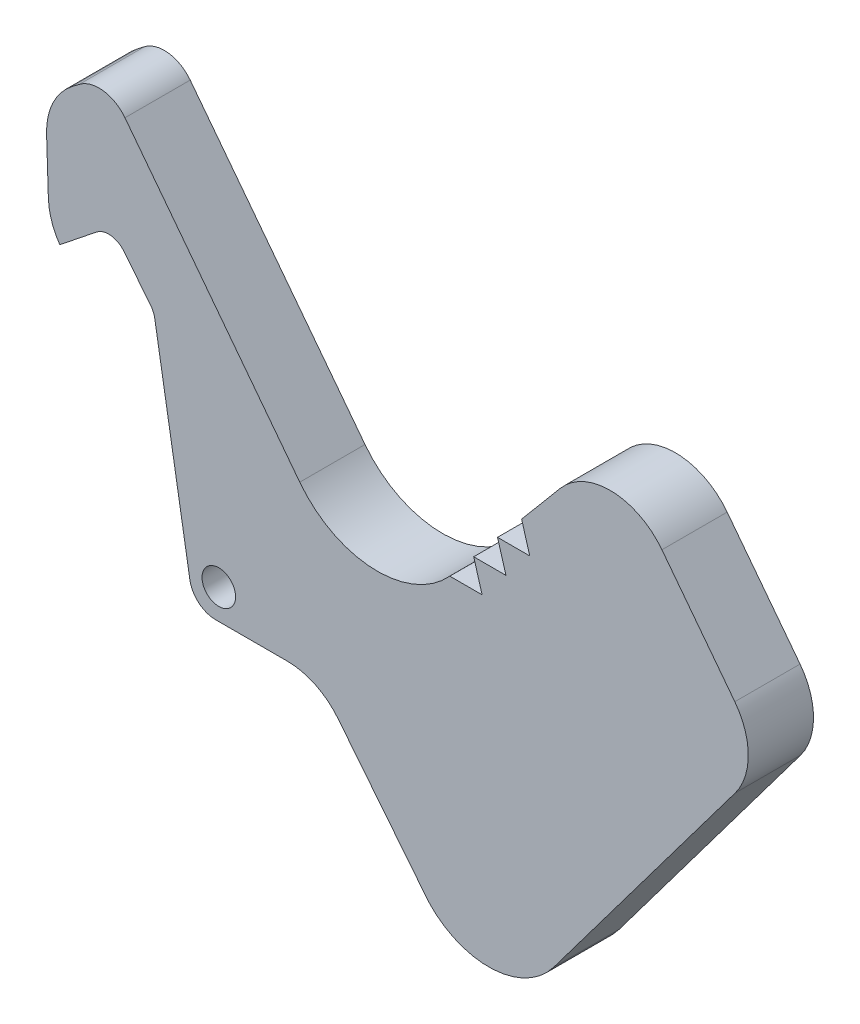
ISO-10303-21;
HEADER;
FILE_DESCRIPTION(('STEP AP214'),'2;1');
FILE_NAME('part.step','',(''),(''),'','','');
FILE_SCHEMA(('AUTOMOTIVE_DESIGN { 1 0 10303 214 1 1 1 1 }'));
ENDSEC;
DATA;
#1=APPLICATION_CONTEXT('core data for automotive mechanical design processes');
#2=APPLICATION_PROTOCOL_DEFINITION('international standard','automotive_design',2000,#1);
#3=PRODUCT_CONTEXT('',#1,'mechanical');
#4=PRODUCT('Part','Part','',(#3));
#5=PRODUCT_RELATED_PRODUCT_CATEGORY('part','',(#4));
#6=PRODUCT_DEFINITION_FORMATION('','',#4);
#7=PRODUCT_DEFINITION_CONTEXT('part definition',#1,'design');
#8=PRODUCT_DEFINITION('design','',#6,#7);
#9=PRODUCT_DEFINITION_SHAPE('','',#8);
#10=(LENGTH_UNIT() NAMED_UNIT(*) SI_UNIT(.MILLI.,.METRE.));
#11=(NAMED_UNIT(*) PLANE_ANGLE_UNIT() SI_UNIT($,.RADIAN.));
#12=(NAMED_UNIT(*) SI_UNIT($,.STERADIAN.) SOLID_ANGLE_UNIT());
#13=UNCERTAINTY_MEASURE_WITH_UNIT(LENGTH_MEASURE(1.E-05),#10,'distance_accuracy_value','');
#14=(GEOMETRIC_REPRESENTATION_CONTEXT(3) GLOBAL_UNCERTAINTY_ASSIGNED_CONTEXT((#13)) GLOBAL_UNIT_ASSIGNED_CONTEXT((#10,
#11,#12)) REPRESENTATION_CONTEXT('',''));
#15=CARTESIAN_POINT('',(0.,0.,0.));
#16=DIRECTION('',(0.,0.,1.));
#17=DIRECTION('',(1.,0.,0.));
#18=AXIS2_PLACEMENT_3D('',#15,#16,#17);
#19=CARTESIAN_POINT('',(50.298696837,93.87980843,0.));
#20=DIRECTION('',(0.959637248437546,0.281240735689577,0.));
#21=DIRECTION('',(-0.281240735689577,0.959637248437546,0.));
#22=AXIS2_PLACEMENT_3D('',#19,#20,#21);
#23=PLANE('',#22);
#24=DIRECTION('',(0.,0.,1.));
#25=VECTOR('',#24,1.);
#26=CARTESIAN_POINT('',(50.298696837,93.87980843,1.27));
#27=LINE('',#26,#25);
#28=CARTESIAN_POINT('',(50.298696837,93.87980843,0.));
#29=VERTEX_POINT('',#28);
#30=CARTESIAN_POINT('',(50.298696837,93.87980843,2.54));
#31=VERTEX_POINT('',#30);
#32=EDGE_CURVE('E304',#29,#31,#27,.T.);
#33=ORIENTED_EDGE('',*,*,#32,.T.);
#34=DIRECTION('',(0.281240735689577,-0.959637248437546,0.));
#35=VECTOR('',#34,1.);
#36=CARTESIAN_POINT('',(50.1346680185,94.4395003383,2.54));
#37=LINE('',#36,#35);
#38=CARTESIAN_POINT('',(49.9706392,94.9991922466,2.54));
#39=VERTEX_POINT('',#38);
#40=EDGE_CURVE('E310',#39,#31,#37,.T.);
#41=ORIENTED_EDGE('',*,*,#40,.F.);
#42=DIRECTION('',(0.,0.,-1.));
#43=VECTOR('',#42,1.);
#44=CARTESIAN_POINT('',(49.9706392,94.9991922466,1.27));
#45=LINE('',#44,#43);
#46=CARTESIAN_POINT('',(49.9706392,94.9991922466,0.));
#47=VERTEX_POINT('',#46);
#48=EDGE_CURVE('E292',#39,#47,#45,.T.);
#49=ORIENTED_EDGE('',*,*,#48,.T.);
#50=DIRECTION('',(-0.281240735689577,0.959637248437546,0.));
#51=VECTOR('',#50,1.);
#52=CARTESIAN_POINT('',(50.1346680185,94.4395003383,0.));
#53=LINE('',#52,#51);
#54=EDGE_CURVE('E307',#29,#47,#53,.T.);
#55=ORIENTED_EDGE('',*,*,#54,.F.);
#56=EDGE_LOOP('',(#33,#41,#49,#55));
#57=FACE_BOUND('',#56,.T.);
#58=ADVANCED_FACE('F16',(#57),#23,.F.);
#59=CARTESIAN_POINT('',(49.0432790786,93.87980843,2.54));
#60=DIRECTION('',(0.,-1.,0.));
#61=DIRECTION('',(0.,0.,-1.));
#62=AXIS2_PLACEMENT_3D('',#59,#60,#61);
#63=PLANE('',#62);
#64=DIRECTION('',(0.,0.,1.));
#65=VECTOR('',#64,1.);
#66=CARTESIAN_POINT('',(49.0432790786,93.87980843,1.27));
#67=LINE('',#66,#65);
#68=CARTESIAN_POINT('',(49.0432790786,93.87980843,0.));
#69=VERTEX_POINT('',#68);
#70=CARTESIAN_POINT('',(49.0432790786,93.87980843,2.54));
#71=VERTEX_POINT('',#70);
#72=EDGE_CURVE('E286',#69,#71,#67,.T.);
#73=ORIENTED_EDGE('',*,*,#72,.T.);
#74=DIRECTION('',(-1.,0.,0.));
#75=VECTOR('',#74,1.);
#76=CARTESIAN_POINT('',(49.6709879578,93.87980843,2.54));
#77=LINE('',#76,#75);
#78=EDGE_CURVE('E301',#31,#71,#77,.T.);
#79=ORIENTED_EDGE('',*,*,#78,.F.);
#80=ORIENTED_EDGE('',*,*,#32,.F.);
#81=DIRECTION('',(1.,0.,0.));
#82=VECTOR('',#81,1.);
#83=CARTESIAN_POINT('',(49.6709879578,93.87980843,0.));
#84=LINE('',#83,#82);
#85=EDGE_CURVE('E296',#69,#29,#84,.T.);
#86=ORIENTED_EDGE('',*,*,#85,.F.);
#87=EDGE_LOOP('',(#73,#79,#80,#86));
#88=FACE_BOUND('',#87,.T.);
#89=ADVANCED_FACE('F714',(#88),#63,.F.);
#90=CARTESIAN_POINT('',(49.9706392,94.9991922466,2.54));
#91=DIRECTION('',(0.,-1.,0.));
#92=DIRECTION('',(0.,0.,-1.));
#93=AXIS2_PLACEMENT_3D('',#90,#91,#92);
#94=PLANE('',#93);
#95=ORIENTED_EDGE('',*,*,#48,.F.);
#96=DIRECTION('',(-1.,0.,0.));
#97=VECTOR('',#96,1.);
#98=CARTESIAN_POINT('',(50.5983462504,94.9991922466,2.54));
#99=LINE('',#98,#97);
#100=CARTESIAN_POINT('',(51.2260533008,94.9991922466,2.54));
#101=VERTEX_POINT('',#100);
#102=EDGE_CURVE('E293',#101,#39,#99,.T.);
#103=ORIENTED_EDGE('',*,*,#102,.F.);
#104=DIRECTION('',(0.,0.,-1.));
#105=VECTOR('',#104,1.);
#106=CARTESIAN_POINT('',(51.2260533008,94.9991922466,1.27));
#107=LINE('',#106,#105);
#108=CARTESIAN_POINT('',(51.2260533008,94.9991922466,0.));
#109=VERTEX_POINT('',#108);
#110=EDGE_CURVE('E265',#101,#109,#107,.T.);
#111=ORIENTED_EDGE('',*,*,#110,.T.);
#112=DIRECTION('',(1.,0.,0.));
#113=VECTOR('',#112,1.);
#114=CARTESIAN_POINT('',(50.5983462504,94.9991922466,0.));
#115=LINE('',#114,#113);
#116=EDGE_CURVE('E289',#47,#109,#115,.T.);
#117=ORIENTED_EDGE('',*,*,#116,.F.);
#118=EDGE_LOOP('',(#95,#103,#111,#117));
#119=FACE_BOUND('',#118,.T.);
#120=ADVANCED_FACE('F705',(#119),#94,.F.);
#121=CARTESIAN_POINT('',(49.3713376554,92.7604213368,0.));
#122=DIRECTION('',(0.959637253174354,0.281240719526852,0.));
#123=DIRECTION('',(-0.281240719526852,0.959637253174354,0.));
#124=AXIS2_PLACEMENT_3D('',#121,#122,#123);
#125=PLANE('',#124);
#126=DIRECTION('',(0.,0.,1.));
#127=VECTOR('',#126,1.);
#128=CARTESIAN_POINT('',(49.3713376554,92.7604213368,1.27));
#129=LINE('',#128,#127);
#130=CARTESIAN_POINT('',(49.3713376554,92.7604213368,0.));
#131=VERTEX_POINT('',#130);
#132=CARTESIAN_POINT('',(49.3713376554,92.7604213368,2.54));
#133=VERTEX_POINT('',#132);
#134=EDGE_CURVE('E259',#131,#133,#129,.T.);
#135=ORIENTED_EDGE('',*,*,#134,.T.);
#136=DIRECTION('',(0.281240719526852,-0.959637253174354,0.));
#137=VECTOR('',#136,1.);
#138=CARTESIAN_POINT('',(49.207308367,93.3201148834,2.54));
#139=LINE('',#138,#137);
#140=EDGE_CURVE('E283',#71,#133,#139,.T.);
#141=ORIENTED_EDGE('',*,*,#140,.F.);
#142=ORIENTED_EDGE('',*,*,#72,.F.);
#143=DIRECTION('',(-0.281240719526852,0.959637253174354,0.));
#144=VECTOR('',#143,1.);
#145=CARTESIAN_POINT('',(49.207308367,93.3201148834,0.));
#146=LINE('',#145,#144);
#147=EDGE_CURVE('E272',#131,#69,#146,.T.);
#148=ORIENTED_EDGE('',*,*,#147,.F.);
#149=EDGE_LOOP('',(#135,#141,#142,#148));
#150=FACE_BOUND('',#149,.T.);
#151=ADVANCED_FACE('F697',(#150),#125,.F.);
#152=CARTESIAN_POINT('',(36.4664540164,96.0658623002,0.));
#153=DIRECTION('',(0.781083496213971,0.624426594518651,0.));
#154=DIRECTION('',(-0.624426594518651,0.781083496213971,0.));
#155=AXIS2_PLACEMENT_3D('',#152,#153,#154);
#156=PLANE('',#155);
#157=DIRECTION('',(0.,0.,1.));
#158=VECTOR('',#157,1.);
#159=CARTESIAN_POINT('',(36.4664540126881,96.0658622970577,1.27));
#160=LINE('',#159,#158);
#161=CARTESIAN_POINT('',(36.4664540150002,96.0658622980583,2.54));
#162=VERTEX_POINT('',#161);
#163=CARTESIAN_POINT('',(36.4664540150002,96.0658622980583,0.));
#164=VERTEX_POINT('',#163);
#165=EDGE_CURVE('E235',#162,#164,#160,.F.);
#166=ORIENTED_EDGE('',*,*,#165,.F.);
#167=DIRECTION('',(0.624426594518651,-0.781083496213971,0.));
#168=VECTOR('',#167,1.);
#169=CARTESIAN_POINT('',(35.9467267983,96.7159793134,2.54));
#170=LINE('',#169,#168);
#171=CARTESIAN_POINT('',(35.4269995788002,97.3660963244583,2.54));
#172=VERTEX_POINT('',#171);
#173=EDGE_CURVE('E269',#172,#162,#170,.T.);
#174=ORIENTED_EDGE('',*,*,#173,.F.);
#175=DIRECTION('',(0.,0.,-1.));
#176=VECTOR('',#175,1.);
#177=CARTESIAN_POINT('',(35.4269995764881,97.3660963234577,1.27));
#178=LINE('',#177,#176);
#179=CARTESIAN_POINT('',(35.4269995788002,97.3660963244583,0.));
#180=VERTEX_POINT('',#179);
#181=EDGE_CURVE('E242',#180,#172,#178,.F.);
#182=ORIENTED_EDGE('',*,*,#181,.F.);
#183=DIRECTION('',(-0.624426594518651,0.781083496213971,0.));
#184=VECTOR('',#183,1.);
#185=CARTESIAN_POINT('',(35.9467267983,96.7159793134,0.));
#186=LINE('',#185,#184);
#187=EDGE_CURVE('E266',#164,#180,#186,.T.);
#188=ORIENTED_EDGE('',*,*,#187,.F.);
#189=EDGE_LOOP('',(#166,#174,#182,#188));
#190=FACE_BOUND('',#189,.T.);
#191=ADVANCED_FACE('F440',(#190),#156,.F.);
#192=CARTESIAN_POINT('',(51.2260533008,94.9991922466,0.));
#193=DIRECTION('',(0.959637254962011,0.281240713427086,0.));
#194=DIRECTION('',(-0.281240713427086,0.959637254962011,0.));
#195=AXIS2_PLACEMENT_3D('',#192,#193,#194);
#196=PLANE('',#195);
#197=ORIENTED_EDGE('',*,*,#110,.F.);
#198=DIRECTION('',(0.281240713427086,-0.959637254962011,0.));
#199=VECTOR('',#198,1.);
#200=CARTESIAN_POINT('',(51.0673753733,95.5406261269,2.54));
#201=LINE('',#200,#199);
#202=CARTESIAN_POINT('',(50.9086974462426,96.0820600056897,2.54));
#203=VERTEX_POINT('',#202);
#204=EDGE_CURVE('E262',#203,#101,#201,.T.);
#205=ORIENTED_EDGE('',*,*,#204,.F.);
#206=DIRECTION('',(0.,0.,-1.));
#207=VECTOR('',#206,1.);
#208=CARTESIAN_POINT('',(50.9086974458,96.0820600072,1.27));
#209=LINE('',#208,#207);
#210=CARTESIAN_POINT('',(50.9086974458,96.0820600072,0.));
#211=VERTEX_POINT('',#210);
#212=EDGE_CURVE('E396',#203,#211,#209,.T.);
#213=ORIENTED_EDGE('',*,*,#212,.T.);
#214=DIRECTION('',(-0.281240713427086,0.959637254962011,0.));
#215=VECTOR('',#214,1.);
#216=CARTESIAN_POINT('',(51.0673753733,95.5406261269,0.));
#217=LINE('',#216,#215);
#218=EDGE_CURVE('E267',#109,#211,#217,.T.);
#219=ORIENTED_EDGE('',*,*,#218,.F.);
#220=EDGE_LOOP('',(#197,#205,#213,#219));
#221=FACE_BOUND('',#220,.T.);
#222=ADVANCED_FACE('F680',(#221),#196,.F.);
#223=CARTESIAN_POINT('',(48.1120035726,92.7604213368,2.54));
#224=DIRECTION('',(0.,-1.,0.));
#225=DIRECTION('',(0.,0.,-1.));
#226=AXIS2_PLACEMENT_3D('',#223,#224,#225);
#227=PLANE('',#226);
#228=DIRECTION('',(0.,0.,1.));
#229=VECTOR('',#228,1.);
#230=CARTESIAN_POINT('',(48.1120035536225,92.7604213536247,1.27));
#231=LINE('',#230,#229);
#232=CARTESIAN_POINT('',(48.1120035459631,92.7604213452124,2.54));
#233=VERTEX_POINT('',#232);
#234=CARTESIAN_POINT('',(48.1120035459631,92.7604213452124,0.));
#235=VERTEX_POINT('',#234);
#236=EDGE_CURVE('E393',#233,#235,#231,.F.);
#237=ORIENTED_EDGE('',*,*,#236,.F.);
#238=DIRECTION('',(-1.,0.,0.));
#239=VECTOR('',#238,1.);
#240=CARTESIAN_POINT('',(48.741670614,92.7604213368,2.54));
#241=LINE('',#240,#239);
#242=EDGE_CURVE('E257',#133,#233,#241,.T.);
#243=ORIENTED_EDGE('',*,*,#242,.F.);
#244=ORIENTED_EDGE('',*,*,#134,.F.);
#245=DIRECTION('',(1.,0.,0.));
#246=VECTOR('',#245,1.);
#247=CARTESIAN_POINT('',(48.741670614,92.7604213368,0.));
#248=LINE('',#247,#246);
#249=EDGE_CURVE('E252',#235,#131,#248,.T.);
#250=ORIENTED_EDGE('',*,*,#249,.F.);
#251=EDGE_LOOP('',(#237,#243,#244,#250));
#252=FACE_BOUND('',#251,.T.);
#253=ADVANCED_FACE('F461',(#252),#227,.F.);
#254=CARTESIAN_POINT('',(33.406604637,101.9169737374,0.));
#255=DIRECTION('',(0.608103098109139,-0.79385806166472,0.));
#256=DIRECTION('',(0.79385806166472,0.608103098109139,0.));
#257=AXIS2_PLACEMENT_3D('',#254,#255,#256);
#258=PLANE('',#257);
#259=DIRECTION('',(0.,0.,-1.));
#260=VECTOR('',#259,1.);
#261=CARTESIAN_POINT('',(33.4066046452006,101.916973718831,1.27));
#262=LINE('',#261,#260);
#263=CARTESIAN_POINT('',(33.4066046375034,101.91697372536,0.));
#264=VERTEX_POINT('',#263);
#265=CARTESIAN_POINT('',(33.4066046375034,101.91697372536,2.54));
#266=VERTEX_POINT('',#265);
#267=EDGE_CURVE('E195',#264,#266,#262,.F.);
#268=ORIENTED_EDGE('',*,*,#267,.T.);
#269=DIRECTION('',(-0.79385806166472,-0.608103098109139,0.));
#270=VECTOR('',#269,1.);
#271=CARTESIAN_POINT('',(33.5452185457,102.0231533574,2.54));
#272=LINE('',#271,#270);
#273=CARTESIAN_POINT('',(33.6838324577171,102.129332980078,2.54));
#274=VERTEX_POINT('',#273);
#275=EDGE_CURVE('E179',#274,#266,#272,.T.);
#276=ORIENTED_EDGE('',*,*,#275,.F.);
#277=DIRECTION('',(0.,0.,1.));
#278=VECTOR('',#277,1.);
#279=CARTESIAN_POINT('',(33.6838324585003,102.129332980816,1.27));
#280=LINE('',#279,#278);
#281=CARTESIAN_POINT('',(33.6838324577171,102.129332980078,0.));
#282=VERTEX_POINT('',#281);
#283=EDGE_CURVE('E385',#274,#282,#280,.F.);
#284=ORIENTED_EDGE('',*,*,#283,.T.);
#285=DIRECTION('',(0.79385806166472,0.608103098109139,0.));
#286=VECTOR('',#285,1.);
#287=CARTESIAN_POINT('',(33.5452185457,102.0231533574,0.));
#288=LINE('',#287,#286);
#289=EDGE_CURVE('E247',#264,#282,#288,.T.);
#290=ORIENTED_EDGE('',*,*,#289,.F.);
#291=EDGE_LOOP('',(#268,#276,#284,#290));
#292=FACE_BOUND('',#291,.T.);
#293=ADVANCED_FACE('F453',(#292),#258,.F.);
#294=CARTESIAN_POINT('',(35.0202061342,97.7783260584,2.54));
#295=DIRECTION('',(0.,0.,-1.));
#296=DIRECTION('',(-1.,0.,0.));
#297=AXIS2_PLACEMENT_3D('',#294,#295,#296);
#298=CYLINDRICAL_SURFACE('',#297,2.54);
#299=DIRECTION('',(0.,0.,1.));
#300=VECTOR('',#299,1.);
#301=CARTESIAN_POINT('',(32.9254363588,96.3418234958,1.27));
#302=LINE('',#301,#300);
#303=CARTESIAN_POINT('',(32.9254363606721,96.3418234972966,0.));
#304=VERTEX_POINT('',#303);
#305=CARTESIAN_POINT('',(32.925436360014,96.3418234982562,2.54));
#306=VERTEX_POINT('',#305);
#307=EDGE_CURVE('E379',#304,#306,#302,.T.);
#308=ORIENTED_EDGE('',*,*,#307,.T.);
#309=CARTESIAN_POINT('',(35.0202061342,97.7783260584,2.54));
#310=DIRECTION('',(0.,0.,-1.));
#311=DIRECTION('',(-1.,0.,0.));
#312=AXIS2_PLACEMENT_3D('',#309,#310,#311);
#313=CIRCLE('',#312,2.54);
#314=CARTESIAN_POINT('',(32.4815483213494,97.6957639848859,2.54));
#315=VERTEX_POINT('',#314);
#316=EDGE_CURVE('E20',#315,#306,#313,.F.);
#317=ORIENTED_EDGE('',*,*,#316,.F.);
#318=DIRECTION('',(0.,0.,-1.));
#319=VECTOR('',#318,1.);
#320=CARTESIAN_POINT('',(32.481548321,97.6957639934,1.27));
#321=LINE('',#320,#319);
#322=CARTESIAN_POINT('',(32.4815483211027,97.695763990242,0.));
#323=VERTEX_POINT('',#322);
#324=EDGE_CURVE('E194',#315,#323,#321,.T.);
#325=ORIENTED_EDGE('',*,*,#324,.T.);
#326=CARTESIAN_POINT('',(35.0202061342,97.7783260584,0.));
#327=DIRECTION('',(0.,0.,-1.));
#328=DIRECTION('',(-1.,0.,0.));
#329=AXIS2_PLACEMENT_3D('',#326,#327,#328);
#330=CIRCLE('',#329,2.54);
#331=EDGE_CURVE('E244',#304,#323,#330,.T.);
#332=ORIENTED_EDGE('',*,*,#331,.F.);
#333=EDGE_LOOP('',(#308,#317,#325,#332));
#334=FACE_BOUND('',#333,.T.);
#335=ADVANCED_FACE('F451',(#334),#298,.T.);
#336=CARTESIAN_POINT('',(34.8318139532,96.8902832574,2.54));
#337=DIRECTION('',(0.,0.,-1.));
#338=DIRECTION('',(-1.,0.,0.));
#339=AXIS2_PLACEMENT_3D('',#336,#337,#338);
#340=CYLINDRICAL_SURFACE('',#339,0.761999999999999);
#341=CARTESIAN_POINT('',(34.8318139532,96.8902832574,2.54));
#342=DIRECTION('',(0.,0.,-1.));
#343=DIRECTION('',(-1.,0.,0.));
#344=AXIS2_PLACEMENT_3D('',#341,#342,#343);
#345=CIRCLE('',#344,0.761999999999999);
#346=CARTESIAN_POINT('',(34.3560008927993,97.4854688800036,2.54));
#347=VERTEX_POINT('',#346);
#348=EDGE_CURVE('E240',#172,#347,#345,.F.);
#349=ORIENTED_EDGE('',*,*,#348,.T.);
#350=DIRECTION('',(0.,0.,-1.));
#351=VECTOR('',#350,1.);
#352=CARTESIAN_POINT('',(34.356000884,97.4854688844,1.27));
#353=LINE('',#352,#351);
#354=CARTESIAN_POINT('',(34.3560008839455,97.4854688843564,0.));
#355=VERTEX_POINT('',#354);
#356=EDGE_CURVE('E376',#347,#355,#353,.T.);
#357=ORIENTED_EDGE('',*,*,#356,.T.);
#358=CARTESIAN_POINT('',(34.8318139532,96.8902832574,0.));
#359=DIRECTION('',(0.,0.,-1.));
#360=DIRECTION('',(-1.,0.,0.));
#361=AXIS2_PLACEMENT_3D('',#358,#359,#360);
#362=CIRCLE('',#361,0.761999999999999);
#363=EDGE_CURVE('E243',#355,#180,#362,.T.);
#364=ORIENTED_EDGE('',*,*,#363,.T.);
#365=ORIENTED_EDGE('',*,*,#181,.T.);
#366=EDGE_LOOP('',(#349,#357,#364,#365));
#367=FACE_BOUND('',#366,.T.);
#368=ADVANCED_FACE('F444',(#367),#340,.F.);
#369=CARTESIAN_POINT('',(35.8712683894,95.590049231,2.54));
#370=DIRECTION('',(0.,0.,-1.));
#371=DIRECTION('',(-1.,0.,0.));
#372=AXIS2_PLACEMENT_3D('',#369,#370,#371);
#373=CYLINDRICAL_SURFACE('',#372,0.761999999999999);
#374=CARTESIAN_POINT('',(35.8712683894,95.590049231,2.54));
#375=DIRECTION('',(0.,0.,-1.));
#376=DIRECTION('',(-1.,0.,0.));
#377=AXIS2_PLACEMENT_3D('',#374,#375,#376);
#378=CIRCLE('',#377,0.761999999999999);
#379=CARTESIAN_POINT('',(36.6227078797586,95.7164718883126,2.54));
#380=VERTEX_POINT('',#379);
#381=EDGE_CURVE('E236',#380,#162,#378,.F.);
#382=ORIENTED_EDGE('',*,*,#381,.T.);
#383=ORIENTED_EDGE('',*,*,#165,.T.);
#384=CARTESIAN_POINT('',(35.8712683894,95.590049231,0.));
#385=DIRECTION('',(0.,0.,-1.));
#386=DIRECTION('',(-1.,0.,0.));
#387=AXIS2_PLACEMENT_3D('',#384,#385,#386);
#388=CIRCLE('',#387,0.761999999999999);
#389=CARTESIAN_POINT('',(36.6227078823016,95.7164718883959,0.));
#390=VERTEX_POINT('',#389);
#391=EDGE_CURVE('E238',#164,#390,#388,.T.);
#392=ORIENTED_EDGE('',*,*,#391,.T.);
#393=DIRECTION('',(0.,0.,1.));
#394=VECTOR('',#393,1.);
#395=CARTESIAN_POINT('',(36.6227078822,95.716471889,1.27));
#396=LINE('',#395,#394);
#397=EDGE_CURVE('E373',#390,#380,#396,.T.);
#398=ORIENTED_EDGE('',*,*,#397,.T.);
#399=EDGE_LOOP('',(#382,#383,#392,#398));
#400=FACE_BOUND('',#399,.T.);
#401=ADVANCED_FACE('F437',(#400),#373,.F.);
#402=CARTESIAN_POINT('',(38.9937896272,87.7469157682,2.54));
#403=DIRECTION('',(0.,0.,-1.));
#404=DIRECTION('',(-1.,0.,0.));
#405=AXIS2_PLACEMENT_3D('',#402,#403,#404);
#406=CYLINDRICAL_SURFACE('',#405,1.016);
#407=DIRECTION('',(0.,0.,1.));
#408=VECTOR('',#407,1.);
#409=CARTESIAN_POINT('',(38.9937896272,86.7309157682,1.27));
#410=LINE('',#409,#408);
#411=CARTESIAN_POINT('',(38.9937896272,86.7309157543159,0.));
#412=VERTEX_POINT('',#411);
#413=CARTESIAN_POINT('',(38.9937896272,86.7309157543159,2.54));
#414=VERTEX_POINT('',#413);
#415=EDGE_CURVE('E369',#412,#414,#410,.T.);
#416=ORIENTED_EDGE('',*,*,#415,.T.);
#417=CARTESIAN_POINT('',(38.9937896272,87.7469157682,2.54));
#418=DIRECTION('',(0.,0.,-1.));
#419=DIRECTION('',(-1.,0.,0.));
#420=AXIS2_PLACEMENT_3D('',#417,#418,#419);
#421=CIRCLE('',#420,1.016);
#422=CARTESIAN_POINT('',(37.9918702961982,87.5783522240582,2.54));
#423=VERTEX_POINT('',#422);
#424=EDGE_CURVE('E233',#423,#414,#421,.F.);
#425=ORIENTED_EDGE('',*,*,#424,.F.);
#426=DIRECTION('',(0.,0.,-1.));
#427=VECTOR('',#426,1.);
#428=CARTESIAN_POINT('',(37.991870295,87.5783522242,1.27));
#429=LINE('',#428,#427);
#430=CARTESIAN_POINT('',(37.991870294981,87.5783522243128,0.));
#431=VERTEX_POINT('',#430);
#432=EDGE_CURVE('E372',#423,#431,#429,.T.);
#433=ORIENTED_EDGE('',*,*,#432,.T.);
#434=CARTESIAN_POINT('',(38.9937896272,87.7469157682,0.));
#435=DIRECTION('',(0.,0.,-1.));
#436=DIRECTION('',(-1.,0.,0.));
#437=AXIS2_PLACEMENT_3D('',#434,#435,#436);
#438=CIRCLE('',#437,1.016);
#439=EDGE_CURVE('E230',#412,#431,#438,.T.);
#440=ORIENTED_EDGE('',*,*,#439,.F.);
#441=EDGE_LOOP('',(#416,#425,#433,#440));
#442=FACE_BOUND('',#441,.T.);
#443=ADVANCED_FACE('F429',(#442),#406,.T.);
#444=CARTESIAN_POINT('',(47.302062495,81.3511618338,0.));
#445=DIRECTION('',(0.781083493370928,0.624426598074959,0.));
#446=DIRECTION('',(-0.624426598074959,0.781083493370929,0.));
#447=AXIS2_PLACEMENT_3D('',#444,#445,#446);
#448=PLANE('',#447);
#449=DIRECTION('',(0.,0.,-1.));
#450=VECTOR('',#449,1.);
#451=CARTESIAN_POINT('',(47.3020624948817,81.3511617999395,1.27));
#452=LINE('',#451,#450);
#453=CARTESIAN_POINT('',(47.3020625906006,81.3511616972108,0.));
#454=VERTEX_POINT('',#453);
#455=CARTESIAN_POINT('',(47.3020625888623,81.3511616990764,2.54));
#456=VERTEX_POINT('',#455);
#457=EDGE_CURVE('E232',#454,#456,#452,.F.);
#458=ORIENTED_EDGE('',*,*,#457,.T.);
#459=DIRECTION('',(0.62442659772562,-0.781083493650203,0.));
#460=VECTOR('',#459,1.);
#461=CARTESIAN_POINT('',(43.7639187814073,85.7769592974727,2.54));
#462=LINE('',#461,#460);
#463=CARTESIAN_POINT('',(43.7639187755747,85.7769593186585,2.54));
#464=VERTEX_POINT('',#463);
#465=EDGE_CURVE('E225',#464,#456,#462,.T.);
#466=ORIENTED_EDGE('',*,*,#465,.F.);
#467=DIRECTION('',(0.,0.,-1.));
#468=VECTOR('',#467,1.);
#469=CARTESIAN_POINT('',(43.7639187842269,85.7769593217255,1.27));
#470=LINE('',#469,#468);
#471=CARTESIAN_POINT('',(43.7639187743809,85.7769593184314,0.));
#472=VERTEX_POINT('',#471);
#473=EDGE_CURVE('E367',#472,#464,#470,.F.);
#474=ORIENTED_EDGE('',*,*,#473,.F.);
#475=DIRECTION('',(-0.624426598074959,0.781083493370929,0.));
#476=VECTOR('',#475,1.);
#477=CARTESIAN_POINT('',(47.302062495,81.3511618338,0.));
#478=LINE('',#477,#476);
#479=EDGE_CURVE('E356',#472,#454,#478,.F.);
#480=ORIENTED_EDGE('',*,*,#479,.T.);
#481=EDGE_LOOP('',(#458,#466,#474,#480));
#482=FACE_BOUND('',#481,.T.);
#483=ADVANCED_FACE('F418',(#482),#448,.F.);
#484=CARTESIAN_POINT('',(49.6270066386,83.517460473,2.54));
#485=DIRECTION('',(0.,0.,-1.));
#486=DIRECTION('',(-1.,0.,0.));
#487=AXIS2_PLACEMENT_3D('',#484,#485,#486);
#488=CYLINDRICAL_SURFACE('',#487,3.1777689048);
#489=DIRECTION('',(0.,0.,1.));
#490=VECTOR('',#489,1.);
#491=CARTESIAN_POINT('',(52.1678836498,81.6090163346,1.27));
#492=LINE('',#491,#490);
#493=CARTESIAN_POINT('',(52.1678836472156,81.6090163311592,0.));
#494=VERTEX_POINT('',#493);
#495=CARTESIAN_POINT('',(52.1678836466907,81.6090163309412,2.54));
#496=VERTEX_POINT('',#495);
#497=EDGE_CURVE('E410',#494,#496,#492,.T.);
#498=ORIENTED_EDGE('',*,*,#497,.T.);
#499=CARTESIAN_POINT('',(49.6270066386,83.517460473,2.54));
#500=DIRECTION('',(0.,0.,-1.));
#501=DIRECTION('',(-1.,0.,0.));
#502=AXIS2_PLACEMENT_3D('',#499,#500,#501);
#503=CIRCLE('',#502,3.1777689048);
#504=EDGE_CURVE('E223',#456,#496,#503,.F.);
#505=ORIENTED_EDGE('',*,*,#504,.F.);
#506=ORIENTED_EDGE('',*,*,#457,.F.);
#507=CARTESIAN_POINT('',(49.6270066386,83.517460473,0.));
#508=DIRECTION('',(0.,0.,-1.));
#509=DIRECTION('',(-1.,0.,0.));
#510=AXIS2_PLACEMENT_3D('',#507,#508,#509);
#511=CIRCLE('',#510,3.1777689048);
#512=EDGE_CURVE('E353',#454,#494,#511,.F.);
#513=ORIENTED_EDGE('',*,*,#512,.T.);
#514=EDGE_LOOP('',(#498,#505,#506,#513));
#515=FACE_BOUND('',#514,.T.);
#516=ADVANCED_FACE('F421',(#515),#488,.T.);
#517=CARTESIAN_POINT('',(59.2250201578,91.004793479,0.));
#518=DIRECTION('',(-0.799578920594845,0.600561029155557,0.));
#519=DIRECTION('',(-0.600561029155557,-0.799578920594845,0.));
#520=AXIS2_PLACEMENT_3D('',#517,#518,#519);
#521=PLANE('',#520);
#522=DIRECTION('',(0.,0.,-1.));
#523=VECTOR('',#522,1.);
#524=CARTESIAN_POINT('',(59.2250201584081,91.0047934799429,1.27));
#525=LINE('',#524,#523);
#526=CARTESIAN_POINT('',(59.2250201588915,91.0047934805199,0.));
#527=VERTEX_POINT('',#526);
#528=CARTESIAN_POINT('',(59.225020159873,91.0047934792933,2.54));
#529=VERTEX_POINT('',#528);
#530=EDGE_CURVE('E408',#527,#529,#525,.F.);
#531=ORIENTED_EDGE('',*,*,#530,.T.);
#532=DIRECTION('',(0.600561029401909,0.799578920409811,0.));
#533=VECTOR('',#532,1.);
#534=CARTESIAN_POINT('',(52.1678836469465,81.6090163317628,2.54));
#535=LINE('',#534,#533);
#536=EDGE_CURVE('E221',#496,#529,#535,.T.);
#537=ORIENTED_EDGE('',*,*,#536,.F.);
#538=ORIENTED_EDGE('',*,*,#497,.F.);
#539=DIRECTION('',(-0.600561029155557,-0.799578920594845,0.));
#540=VECTOR('',#539,1.);
#541=CARTESIAN_POINT('',(59.2250201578,91.004793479,0.));
#542=LINE('',#541,#540);
#543=EDGE_CURVE('E350',#494,#527,#542,.F.);
#544=ORIENTED_EDGE('',*,*,#543,.T.);
#545=EDGE_LOOP('',(#531,#537,#538,#544));
#546=FACE_BOUND('',#545,.T.);
#547=ADVANCED_FACE('F497',(#546),#521,.F.);
#548=CARTESIAN_POINT('',(57.194089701,92.5302184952,2.54));
#549=DIRECTION('',(0.,0.,-1.));
#550=DIRECTION('',(-1.,0.,0.));
#551=AXIS2_PLACEMENT_3D('',#548,#549,#550);
#552=CYLINDRICAL_SURFACE('',#551,2.54);
#553=DIRECTION('',(0.,0.,1.));
#554=VECTOR('',#553,1.);
#555=CARTESIAN_POINT('',(59.2104891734,94.0748003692,1.27));
#556=LINE('',#555,#554);
#557=CARTESIAN_POINT('',(59.2104891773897,94.0748003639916,0.));
#558=VERTEX_POINT('',#557);
#559=CARTESIAN_POINT('',(59.2104891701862,94.0748003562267,2.54));
#560=VERTEX_POINT('',#559);
#561=EDGE_CURVE('E405',#558,#560,#556,.T.);
#562=ORIENTED_EDGE('',*,*,#561,.T.);
#563=CARTESIAN_POINT('',(57.194089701,92.5302184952,2.54));
#564=DIRECTION('',(0.,0.,-1.));
#565=DIRECTION('',(-1.,0.,0.));
#566=AXIS2_PLACEMENT_3D('',#563,#564,#565);
#567=CIRCLE('',#566,2.54);
#568=EDGE_CURVE('E219',#529,#560,#567,.F.);
#569=ORIENTED_EDGE('',*,*,#568,.F.);
#570=ORIENTED_EDGE('',*,*,#530,.F.);
#571=CARTESIAN_POINT('',(57.194089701,92.5302184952,0.));
#572=DIRECTION('',(0.,0.,-1.));
#573=DIRECTION('',(-1.,0.,0.));
#574=AXIS2_PLACEMENT_3D('',#571,#572,#573);
#575=CIRCLE('',#574,2.54);
#576=EDGE_CURVE('E347',#527,#558,#575,.F.);
#577=ORIENTED_EDGE('',*,*,#576,.T.);
#578=EDGE_LOOP('',(#562,#569,#570,#577));
#579=FACE_BOUND('',#578,.T.);
#580=ADVANCED_FACE('F494',(#579),#552,.T.);
#581=CARTESIAN_POINT('',(56.3724011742,97.779828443,0.));
#582=DIRECTION('',(-0.793858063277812,-0.608103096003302,0.));
#583=DIRECTION('',(0.608103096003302,-0.793858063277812,0.));
#584=AXIS2_PLACEMENT_3D('',#581,#582,#583);
#585=PLANE('',#584);
#586=DIRECTION('',(0.,0.,-1.));
#587=VECTOR('',#586,1.);
#588=CARTESIAN_POINT('',(56.3724011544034,97.7798284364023,1.27));
#589=LINE('',#588,#587);
#590=CARTESIAN_POINT('',(56.3724011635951,97.7798284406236,0.));
#591=VERTEX_POINT('',#590);
#592=CARTESIAN_POINT('',(56.3724011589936,97.7798284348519,2.54));
#593=VERTEX_POINT('',#592);
#594=EDGE_CURVE('E400',#591,#593,#589,.F.);
#595=ORIENTED_EDGE('',*,*,#594,.T.);
#596=DIRECTION('',(-0.608103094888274,0.793858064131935,0.));
#597=VECTOR('',#596,1.);
#598=CARTESIAN_POINT('',(59.210489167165,94.074800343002,2.54));
#599=LINE('',#598,#597);
#600=EDGE_CURVE('E217',#560,#593,#599,.T.);
#601=ORIENTED_EDGE('',*,*,#600,.F.);
#602=ORIENTED_EDGE('',*,*,#561,.F.);
#603=DIRECTION('',(0.608103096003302,-0.793858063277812,0.));
#604=VECTOR('',#603,1.);
#605=CARTESIAN_POINT('',(56.3724011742,97.779828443,0.));
#606=LINE('',#605,#604);
#607=EDGE_CURVE('E344',#558,#591,#606,.F.);
#608=ORIENTED_EDGE('',*,*,#607,.T.);
#609=EDGE_LOOP('',(#595,#601,#602,#608));
#610=FACE_BOUND('',#609,.T.);
#611=ADVANCED_FACE('F492',(#610),#585,.F.);
#612=CARTESIAN_POINT('',(54.3560016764,96.235246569,2.54));
#613=DIRECTION('',(0.,0.,-1.));
#614=DIRECTION('',(-1.,0.,0.));
#615=AXIS2_PLACEMENT_3D('',#612,#613,#614);
#616=CYLINDRICAL_SURFACE('',#615,2.54000000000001);
#617=DIRECTION('',(0.,0.,1.));
#618=VECTOR('',#617,1.);
#619=CARTESIAN_POINT('',(52.411873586,97.8698614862,1.27));
#620=LINE('',#619,#618);
#621=CARTESIAN_POINT('',(52.4118735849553,97.8698614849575,0.));
#622=VERTEX_POINT('',#621);
#623=CARTESIAN_POINT('',(52.4118735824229,97.8698614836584,2.54));
#624=VERTEX_POINT('',#623);
#625=EDGE_CURVE('E397',#622,#624,#620,.T.);
#626=ORIENTED_EDGE('',*,*,#625,.T.);
#627=CARTESIAN_POINT('',(54.3560016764,96.235246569,2.54));
#628=DIRECTION('',(0.,0.,-1.));
#629=DIRECTION('',(-1.,0.,0.));
#630=AXIS2_PLACEMENT_3D('',#627,#628,#629);
#631=CIRCLE('',#630,2.54000000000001);
#632=EDGE_CURVE('E215',#593,#624,#631,.F.);
#633=ORIENTED_EDGE('',*,*,#632,.F.);
#634=ORIENTED_EDGE('',*,*,#594,.F.);
#635=CARTESIAN_POINT('',(54.3560016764,96.235246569,0.));
#636=DIRECTION('',(0.,0.,-1.));
#637=DIRECTION('',(-1.,0.,0.));
#638=AXIS2_PLACEMENT_3D('',#635,#636,#637);
#639=CIRCLE('',#638,2.54000000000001);
#640=EDGE_CURVE('E341',#591,#622,#639,.F.);
#641=ORIENTED_EDGE('',*,*,#640,.T.);
#642=EDGE_LOOP('',(#626,#633,#634,#641));
#643=FACE_BOUND('',#642,.T.);
#644=ADVANCED_FACE('F489',(#643),#616,.T.);
#645=CARTESIAN_POINT('',(50.9086974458,96.0820600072,0.));
#646=DIRECTION('',(0.76540476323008,-0.643549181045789,0.));
#647=DIRECTION('',(0.643549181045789,0.76540476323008,0.));
#648=AXIS2_PLACEMENT_3D('',#645,#646,#647);
#649=PLANE('',#648);
#650=ORIENTED_EDGE('',*,*,#212,.F.);
#651=DIRECTION('',(-0.643549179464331,-0.765404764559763,0.));
#652=VECTOR('',#651,1.);
#653=CARTESIAN_POINT('',(52.4118735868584,97.8698614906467,2.54));
#654=LINE('',#653,#652);
#655=EDGE_CURVE('E212',#624,#203,#654,.T.);
#656=ORIENTED_EDGE('',*,*,#655,.F.);
#657=ORIENTED_EDGE('',*,*,#625,.F.);
#658=DIRECTION('',(0.643549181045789,0.76540476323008,0.));
#659=VECTOR('',#658,1.);
#660=CARTESIAN_POINT('',(50.9086974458,96.0820600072,0.));
#661=LINE('',#660,#659);
#662=EDGE_CURVE('E338',#622,#211,#661,.F.);
#663=ORIENTED_EDGE('',*,*,#662,.T.);
#664=EDGE_LOOP('',(#650,#656,#657,#663));
#665=FACE_BOUND('',#664,.T.);
#666=ADVANCED_FACE('F487',(#665),#649,.F.);
#667=CARTESIAN_POINT('',(45.294793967,95.3254613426,2.54));
#668=DIRECTION('',(0.,0.,-1.));
#669=DIRECTION('',(-1.,0.,0.));
#670=AXIS2_PLACEMENT_3D('',#667,#668,#669);
#671=CYLINDRICAL_SURFACE('',#670,3.81000000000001);
#672=CARTESIAN_POINT('',(45.294793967,95.3254613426,2.54));
#673=DIRECTION('',(0.,0.,-1.));
#674=DIRECTION('',(-1.,0.,0.));
#675=AXIS2_PLACEMENT_3D('',#672,#673,#674);
#676=CIRCLE('',#675,3.81000000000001);
#677=CARTESIAN_POINT('',(42.2701947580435,93.0085885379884,2.54));
#678=VERTEX_POINT('',#677);
#679=EDGE_CURVE('E210',#233,#678,#676,.T.);
#680=ORIENTED_EDGE('',*,*,#679,.F.);
#681=ORIENTED_EDGE('',*,*,#236,.T.);
#682=CARTESIAN_POINT('',(45.294793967,95.3254613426,0.));
#683=DIRECTION('',(0.,0.,-1.));
#684=DIRECTION('',(-1.,0.,0.));
#685=AXIS2_PLACEMENT_3D('',#682,#683,#684);
#686=CIRCLE('',#685,3.81000000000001);
#687=CARTESIAN_POINT('',(42.2701947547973,93.0085885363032,0.));
#688=VERTEX_POINT('',#687);
#689=EDGE_CURVE('E335',#235,#688,#686,.T.);
#690=ORIENTED_EDGE('',*,*,#689,.T.);
#691=DIRECTION('',(0.,0.,1.));
#692=VECTOR('',#691,1.);
#693=CARTESIAN_POINT('',(42.2701947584,93.0085885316,1.27));
#694=LINE('',#693,#692);
#695=EDGE_CURVE('E390',#688,#678,#694,.T.);
#696=ORIENTED_EDGE('',*,*,#695,.T.);
#697=EDGE_LOOP('',(#680,#681,#690,#696));
#698=FACE_BOUND('',#697,.T.);
#699=ADVANCED_FACE('F484',(#698),#671,.F.);
#700=CARTESIAN_POINT('',(35.4643231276,101.8934241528,0.));
#701=DIRECTION('',(-0.793858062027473,-0.608103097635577,0.));
#702=DIRECTION('',(0.608103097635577,-0.793858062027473,0.));
#703=AXIS2_PLACEMENT_3D('',#700,#701,#702);
#704=PLANE('',#703);
#705=DIRECTION('',(0.,0.,-1.));
#706=VECTOR('',#705,1.);
#707=CARTESIAN_POINT('',(35.4643231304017,101.893424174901,1.27));
#708=LINE('',#707,#706);
#709=CARTESIAN_POINT('',(35.4643231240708,101.893424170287,0.));
#710=VERTEX_POINT('',#709);
#711=CARTESIAN_POINT('',(35.4643231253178,101.893424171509,2.54));
#712=VERTEX_POINT('',#711);
#713=EDGE_CURVE('E387',#710,#712,#708,.F.);
#714=ORIENTED_EDGE('',*,*,#713,.T.);
#715=DIRECTION('',(-0.608103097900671,0.793858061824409,0.));
#716=VECTOR('',#715,1.);
#717=CARTESIAN_POINT('',(42.2701947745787,93.0085885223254,2.54));
#718=LINE('',#717,#716);
#719=EDGE_CURVE('E208',#678,#712,#718,.T.);
#720=ORIENTED_EDGE('',*,*,#719,.F.);
#721=ORIENTED_EDGE('',*,*,#695,.F.);
#722=DIRECTION('',(0.608103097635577,-0.793858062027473,0.));
#723=VECTOR('',#722,1.);
#724=CARTESIAN_POINT('',(35.4643231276,101.8934241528,0.));
#725=LINE('',#724,#723);
#726=EDGE_CURVE('E332',#688,#710,#725,.F.);
#727=ORIENTED_EDGE('',*,*,#726,.T.);
#728=EDGE_LOOP('',(#714,#720,#721,#727));
#729=FACE_BOUND('',#728,.T.);
#730=ADVANCED_FACE('F482',(#729),#704,.F.);
#731=CARTESIAN_POINT('',(34.4561233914,101.1211332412,2.54));
#732=DIRECTION('',(0.,0.,-1.));
#733=DIRECTION('',(-1.,0.,0.));
#734=AXIS2_PLACEMENT_3D('',#731,#732,#733);
#735=CYLINDRICAL_SURFACE('',#734,1.27);
#736=ORIENTED_EDGE('',*,*,#283,.F.);
#737=CARTESIAN_POINT('',(34.4561233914,101.1211332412,2.54));
#738=DIRECTION('',(0.,0.,-1.));
#739=DIRECTION('',(-1.,0.,0.));
#740=AXIS2_PLACEMENT_3D('',#737,#738,#739);
#741=CIRCLE('',#740,1.27);
#742=EDGE_CURVE('E183',#712,#274,#741,.F.);
#743=ORIENTED_EDGE('',*,*,#742,.F.);
#744=ORIENTED_EDGE('',*,*,#713,.F.);
#745=CARTESIAN_POINT('',(34.4561233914,101.1211332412,0.));
#746=DIRECTION('',(0.,0.,-1.));
#747=DIRECTION('',(-1.,0.,0.));
#748=AXIS2_PLACEMENT_3D('',#745,#746,#747);
#749=CIRCLE('',#748,1.27);
#750=EDGE_CURVE('E329',#710,#282,#749,.F.);
#751=ORIENTED_EDGE('',*,*,#750,.T.);
#752=EDGE_LOOP('',(#736,#743,#744,#751));
#753=FACE_BOUND('',#752,.T.);
#754=ADVANCED_FACE('F479',(#753),#735,.T.);
#755=CARTESIAN_POINT('',(34.951186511,99.9005742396,2.54));
#756=DIRECTION('',(0.,0.,-1.));
#757=DIRECTION('',(-1.,0.,0.));
#758=AXIS2_PLACEMENT_3D('',#755,#756,#757);
#759=CYLINDRICAL_SURFACE('',#758,2.54);
#760=CARTESIAN_POINT('',(34.951186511,99.9005742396,2.54));
#761=DIRECTION('',(0.,0.,-1.));
#762=DIRECTION('',(-1.,0.,0.));
#763=AXIS2_PLACEMENT_3D('',#760,#761,#762);
#764=CIRCLE('',#763,2.54);
#765=CARTESIAN_POINT('',(32.4125286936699,99.8180121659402,2.54));
#766=VERTEX_POINT('',#765);
#767=EDGE_CURVE('E173',#266,#766,#764,.F.);
#768=ORIENTED_EDGE('',*,*,#767,.F.);
#769=ORIENTED_EDGE('',*,*,#267,.F.);
#770=CARTESIAN_POINT('',(34.951186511,99.9005742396,0.));
#771=DIRECTION('',(0.,0.,-1.));
#772=DIRECTION('',(-1.,0.,0.));
#773=AXIS2_PLACEMENT_3D('',#770,#771,#772);
#774=CIRCLE('',#773,2.54);
#775=CARTESIAN_POINT('',(32.4125286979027,99.8180121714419,0.));
#776=VERTEX_POINT('',#775);
#777=EDGE_CURVE('E190',#264,#776,#774,.F.);
#778=ORIENTED_EDGE('',*,*,#777,.T.);
#779=DIRECTION('',(0.,0.,1.));
#780=VECTOR('',#779,1.);
#781=CARTESIAN_POINT('',(32.4125286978,99.8180121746,1.27));
#782=LINE('',#781,#780);
#783=EDGE_CURVE('E187',#776,#766,#782,.T.);
#784=ORIENTED_EDGE('',*,*,#783,.T.);
#785=EDGE_LOOP('',(#768,#769,#778,#784));
#786=FACE_BOUND('',#785,.T.);
#787=ADVANCED_FACE('F188',(#786),#759,.T.);
#788=CARTESIAN_POINT('',(32.481548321,97.6957639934,0.));
#789=DIRECTION('',(0.999471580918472,0.0325047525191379,0.));
#790=DIRECTION('',(-0.0325047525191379,0.999471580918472,0.));
#791=AXIS2_PLACEMENT_3D('',#788,#789,#790);
#792=PLANE('',#791);
#793=ORIENTED_EDGE('',*,*,#324,.F.);
#794=DIRECTION('',(0.0325047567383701,-0.999471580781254,0.));
#795=VECTOR('',#794,1.);
#796=CARTESIAN_POINT('',(32.4125286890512,99.8180121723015,2.54));
#797=LINE('',#796,#795);
#798=EDGE_CURVE('E177',#766,#315,#797,.T.);
#799=ORIENTED_EDGE('',*,*,#798,.F.);
#800=ORIENTED_EDGE('',*,*,#783,.F.);
#801=DIRECTION('',(-0.0325047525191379,0.999471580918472,0.));
#802=VECTOR('',#801,1.);
#803=CARTESIAN_POINT('',(32.481548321,97.6957639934,0.));
#804=LINE('',#803,#802);
#805=EDGE_CURVE('E326',#776,#323,#804,.F.);
#806=ORIENTED_EDGE('',*,*,#805,.T.);
#807=EDGE_LOOP('',(#793,#799,#800,#806));
#808=FACE_BOUND('',#807,.T.);
#809=ADVANCED_FACE('F198',(#808),#792,.F.);
#810=CARTESIAN_POINT('',(34.356000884,97.4854688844,0.));
#811=DIRECTION('',(-0.624426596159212,0.781083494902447,0.));
#812=DIRECTION('',(-0.781083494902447,-0.624426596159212,0.));
#813=AXIS2_PLACEMENT_3D('',#810,#811,#812);
#814=PLANE('',#813);
#815=ORIENTED_EDGE('',*,*,#356,.F.);
#816=DIRECTION('',(0.781083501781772,0.624426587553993,0.));
#817=VECTOR('',#816,1.);
#818=CARTESIAN_POINT('',(32.9254363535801,96.3418234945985,2.54));
#819=LINE('',#818,#817);
#820=EDGE_CURVE('E200',#306,#347,#819,.T.);
#821=ORIENTED_EDGE('',*,*,#820,.F.);
#822=ORIENTED_EDGE('',*,*,#307,.F.);
#823=DIRECTION('',(-0.781083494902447,-0.624426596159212,0.));
#824=VECTOR('',#823,1.);
#825=CARTESIAN_POINT('',(34.356000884,97.4854688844,0.));
#826=LINE('',#825,#824);
#827=EDGE_CURVE('E323',#304,#355,#826,.F.);
#828=ORIENTED_EDGE('',*,*,#827,.T.);
#829=EDGE_LOOP('',(#815,#821,#822,#828));
#830=FACE_BOUND('',#829,.T.);
#831=ADVANCED_FACE('F449',(#830),#814,.F.);
#832=CARTESIAN_POINT('',(37.991870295,87.5783522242,0.));
#833=DIRECTION('',(0.986141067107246,0.165908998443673,0.));
#834=DIRECTION('',(-0.165908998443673,0.986141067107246,0.));
#835=AXIS2_PLACEMENT_3D('',#832,#833,#834);
#836=PLANE('',#835);
#837=ORIENTED_EDGE('',*,*,#432,.F.);
#838=DIRECTION('',(0.16590899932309,-0.986141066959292,0.));
#839=VECTOR('',#838,1.);
#840=CARTESIAN_POINT('',(36.6227078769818,95.7164718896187,2.54));
#841=LINE('',#840,#839);
#842=EDGE_CURVE('E203',#380,#423,#841,.T.);
#843=ORIENTED_EDGE('',*,*,#842,.F.);
#844=ORIENTED_EDGE('',*,*,#397,.F.);
#845=DIRECTION('',(-0.165908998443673,0.986141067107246,0.));
#846=VECTOR('',#845,1.);
#847=CARTESIAN_POINT('',(37.991870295,87.5783522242,0.));
#848=LINE('',#847,#846);
#849=EDGE_CURVE('E320',#390,#431,#848,.F.);
#850=ORIENTED_EDGE('',*,*,#849,.T.);
#851=EDGE_LOOP('',(#837,#843,#844,#850));
#852=FACE_BOUND('',#851,.T.);
#853=ADVANCED_FACE('F435',(#852),#836,.F.);
#854=CARTESIAN_POINT('',(41.7799667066,86.7309157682,0.));
#855=DIRECTION('',(0.,1.,0.));
#856=DIRECTION('',(-1.,0.,0.));
#857=AXIS2_PLACEMENT_3D('',#854,#855,#856);
#858=PLANE('',#857);
#859=DIRECTION('',(0.,0.,1.));
#860=VECTOR('',#859,1.);
#861=CARTESIAN_POINT('',(41.779966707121,86.7309157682,1.27));
#862=LINE('',#861,#860);
#863=CARTESIAN_POINT('',(41.7799667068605,86.7309157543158,2.54));
#864=VERTEX_POINT('',#863);
#865=CARTESIAN_POINT('',(41.7799667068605,86.7309157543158,0.));
#866=VERTEX_POINT('',#865);
#867=EDGE_CURVE('E35',#864,#866,#862,.F.);
#868=ORIENTED_EDGE('',*,*,#867,.F.);
#869=DIRECTION('',(1.,0.,0.));
#870=VECTOR('',#869,1.);
#871=CARTESIAN_POINT('',(46.072638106,86.7309157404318,2.54));
#872=LINE('',#871,#870);
#873=EDGE_CURVE('E358',#414,#864,#872,.T.);
#874=ORIENTED_EDGE('',*,*,#873,.F.);
#875=ORIENTED_EDGE('',*,*,#415,.F.);
#876=DIRECTION('',(1.,0.,0.));
#877=VECTOR('',#876,1.);
#878=CARTESIAN_POINT('',(46.072638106,86.7309157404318,0.));
#879=LINE('',#878,#877);
#880=EDGE_CURVE('E319',#412,#866,#879,.T.);
#881=ORIENTED_EDGE('',*,*,#880,.T.);
#882=EDGE_LOOP('',(#868,#874,#875,#881));
#883=FACE_BOUND('',#882,.T.);
#884=ADVANCED_FACE('F427',(#883),#858,.F.);
#885=CARTESIAN_POINT('',(41.7799667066,84.1909157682,2.54));
#886=DIRECTION('',(0.,0.,-1.));
#887=DIRECTION('',(-1.,0.,0.));
#888=AXIS2_PLACEMENT_3D('',#885,#886,#887);
#889=CYLINDRICAL_SURFACE('',#888,2.54);
#890=CARTESIAN_POINT('',(41.7799667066,84.1909157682,2.54));
#891=DIRECTION('',(0.,0.,-1.));
#892=DIRECTION('',(-1.,0.,0.));
#893=AXIS2_PLACEMENT_3D('',#890,#891,#892);
#894=CIRCLE('',#893,2.54);
#895=EDGE_CURVE('E227',#864,#464,#894,.T.);
#896=ORIENTED_EDGE('',*,*,#895,.F.);
#897=ORIENTED_EDGE('',*,*,#867,.T.);
#898=CARTESIAN_POINT('',(41.7799667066,84.1909157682,0.));
#899=DIRECTION('',(0.,0.,-1.));
#900=DIRECTION('',(-1.,0.,0.));
#901=AXIS2_PLACEMENT_3D('',#898,#899,#900);
#902=CIRCLE('',#901,2.54);
#903=EDGE_CURVE('E317',#866,#472,#902,.T.);
#904=ORIENTED_EDGE('',*,*,#903,.T.);
#905=ORIENTED_EDGE('',*,*,#473,.T.);
#906=EDGE_LOOP('',(#896,#897,#904,#905));
#907=FACE_BOUND('',#906,.T.);
#908=ADVANCED_FACE('F422',(#907),#889,.F.);
#909=CARTESIAN_POINT('',(32.2472490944,80.2073829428,2.54));
#910=DIRECTION('',(0.,0.,1.));
#911=DIRECTION('',(1.,0.,0.));
#912=AXIS2_PLACEMENT_3D('',#909,#910,#911);
#913=PLANE('',#912);
#914=CARTESIAN_POINT('',(39.1184170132,87.8940258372,2.54));
#915=DIRECTION('',(0.,0.,-1.));
#916=DIRECTION('',(-1.,0.,0.));
#917=AXIS2_PLACEMENT_3D('',#914,#915,#916);
#918=CIRCLE('',#917,0.652539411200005);
#919=CARTESIAN_POINT('',(38.465877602,87.8940258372,2.54));
#920=VERTEX_POINT('',#919);
#921=EDGE_CURVE('E26',#920,#920,#918,.F.);
#922=ORIENTED_EDGE('',*,*,#921,.F.);
#923=EDGE_LOOP('',(#922));
#924=FACE_BOUND('',#923,.T.);
#925=ORIENTED_EDGE('',*,*,#424,.T.);
#926=ORIENTED_EDGE('',*,*,#873,.T.);
#927=ORIENTED_EDGE('',*,*,#895,.T.);
#928=ORIENTED_EDGE('',*,*,#465,.T.);
#929=ORIENTED_EDGE('',*,*,#504,.T.);
#930=ORIENTED_EDGE('',*,*,#536,.T.);
#931=ORIENTED_EDGE('',*,*,#568,.T.);
#932=ORIENTED_EDGE('',*,*,#600,.T.);
#933=ORIENTED_EDGE('',*,*,#632,.T.);
#934=ORIENTED_EDGE('',*,*,#655,.T.);
#935=ORIENTED_EDGE('',*,*,#204,.T.);
#936=ORIENTED_EDGE('',*,*,#102,.T.);
#937=ORIENTED_EDGE('',*,*,#40,.T.);
#938=ORIENTED_EDGE('',*,*,#78,.T.);
#939=ORIENTED_EDGE('',*,*,#140,.T.);
#940=ORIENTED_EDGE('',*,*,#242,.T.);
#941=ORIENTED_EDGE('',*,*,#679,.T.);
#942=ORIENTED_EDGE('',*,*,#719,.T.);
#943=ORIENTED_EDGE('',*,*,#742,.T.);
#944=ORIENTED_EDGE('',*,*,#275,.T.);
#945=ORIENTED_EDGE('',*,*,#767,.T.);
#946=ORIENTED_EDGE('',*,*,#798,.T.);
#947=ORIENTED_EDGE('',*,*,#316,.T.);
#948=ORIENTED_EDGE('',*,*,#820,.T.);
#949=ORIENTED_EDGE('',*,*,#348,.F.);
#950=ORIENTED_EDGE('',*,*,#173,.T.);
#951=ORIENTED_EDGE('',*,*,#381,.F.);
#952=ORIENTED_EDGE('',*,*,#842,.T.);
#953=EDGE_LOOP('',(#925,#926,#927,#928,#929,#930,#931,#932,#933,#934,#935,#936,#937,#938,#939,
#940,#941,#942,#943,#944,#945,#946,#947,#948,#949,#950,#951,#952));
#954=FACE_BOUND('',#953,.T.);
#955=ADVANCED_FACE('F175',(#924,#954),#913,.T.);
#956=CARTESIAN_POINT('',(32.2472490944,80.2073829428,0.));
#957=DIRECTION('',(0.,0.,1.));
#958=DIRECTION('',(1.,0.,0.));
#959=AXIS2_PLACEMENT_3D('',#956,#957,#958);
#960=PLANE('',#959);
#961=CARTESIAN_POINT('',(39.1184170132,87.8940258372,0.));
#962=DIRECTION('',(0.,0.,-1.));
#963=DIRECTION('',(-1.,0.,0.));
#964=AXIS2_PLACEMENT_3D('',#961,#962,#963);
#965=CIRCLE('',#964,0.652539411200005);
#966=CARTESIAN_POINT('',(38.465877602,87.8940258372,0.));
#967=VERTEX_POINT('',#966);
#968=EDGE_CURVE('E11',#967,#967,#965,.T.);
#969=ORIENTED_EDGE('',*,*,#968,.F.);
#970=EDGE_LOOP('',(#969));
#971=FACE_BOUND('',#970,.T.);
#972=ORIENTED_EDGE('',*,*,#880,.F.);
#973=ORIENTED_EDGE('',*,*,#439,.T.);
#974=ORIENTED_EDGE('',*,*,#849,.F.);
#975=ORIENTED_EDGE('',*,*,#391,.F.);
#976=ORIENTED_EDGE('',*,*,#187,.T.);
#977=ORIENTED_EDGE('',*,*,#363,.F.);
#978=ORIENTED_EDGE('',*,*,#827,.F.);
#979=ORIENTED_EDGE('',*,*,#331,.T.);
#980=ORIENTED_EDGE('',*,*,#805,.F.);
#981=ORIENTED_EDGE('',*,*,#777,.F.);
#982=ORIENTED_EDGE('',*,*,#289,.T.);
#983=ORIENTED_EDGE('',*,*,#750,.F.);
#984=ORIENTED_EDGE('',*,*,#726,.F.);
#985=ORIENTED_EDGE('',*,*,#689,.F.);
#986=ORIENTED_EDGE('',*,*,#249,.T.);
#987=ORIENTED_EDGE('',*,*,#147,.T.);
#988=ORIENTED_EDGE('',*,*,#85,.T.);
#989=ORIENTED_EDGE('',*,*,#54,.T.);
#990=ORIENTED_EDGE('',*,*,#116,.T.);
#991=ORIENTED_EDGE('',*,*,#218,.T.);
#992=ORIENTED_EDGE('',*,*,#662,.F.);
#993=ORIENTED_EDGE('',*,*,#640,.F.);
#994=ORIENTED_EDGE('',*,*,#607,.F.);
#995=ORIENTED_EDGE('',*,*,#576,.F.);
#996=ORIENTED_EDGE('',*,*,#543,.F.);
#997=ORIENTED_EDGE('',*,*,#512,.F.);
#998=ORIENTED_EDGE('',*,*,#479,.F.);
#999=ORIENTED_EDGE('',*,*,#903,.F.);
#1000=EDGE_LOOP('',(#972,#973,#974,#975,#976,#977,#978,#979,#980,#981,#982,#983,#984,#985,#986,
#987,#988,#989,#990,#991,#992,#993,#994,#995,#996,#997,#998,#999));
#1001=FACE_BOUND('',#1000,.T.);
#1002=ADVANCED_FACE('F18',(#971,#1001),#960,.F.);
#1003=CARTESIAN_POINT('',(39.1184170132,87.8940258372,2.54));
#1004=DIRECTION('',(0.,0.,-1.));
#1005=DIRECTION('',(-1.,0.,0.));
#1006=AXIS2_PLACEMENT_3D('',#1003,#1004,#1005);
#1007=CYLINDRICAL_SURFACE('',#1006,0.652539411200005);
#1008=ORIENTED_EDGE('',*,*,#968,.T.);
#1009=EDGE_LOOP('',(#1008));
#1010=FACE_BOUND('',#1009,.T.);
#1011=ORIENTED_EDGE('',*,*,#921,.T.);
#1012=EDGE_LOOP('',(#1011));
#1013=FACE_BOUND('',#1012,.T.);
#1014=ADVANCED_FACE('F465',(#1010,#1013),#1007,.F.);
#1015=CLOSED_SHELL('',(#58,#89,#120,#151,#191,#222,#253,#293,#335,#368,#401,#443,#483,#516,#547,
#580,#611,#644,#666,#699,#730,#754,#787,#809,#831,#853,#884,#908,#955,#1002,#1014));
#1016=MANIFOLD_SOLID_BREP('B1',#1015);
#1017=ADVANCED_BREP_SHAPE_REPRESENTATION('',(#18,#1016),#14);
#1018=SHAPE_DEFINITION_REPRESENTATION(#9,#1017);
ENDSEC;
END-ISO-10303-21;
